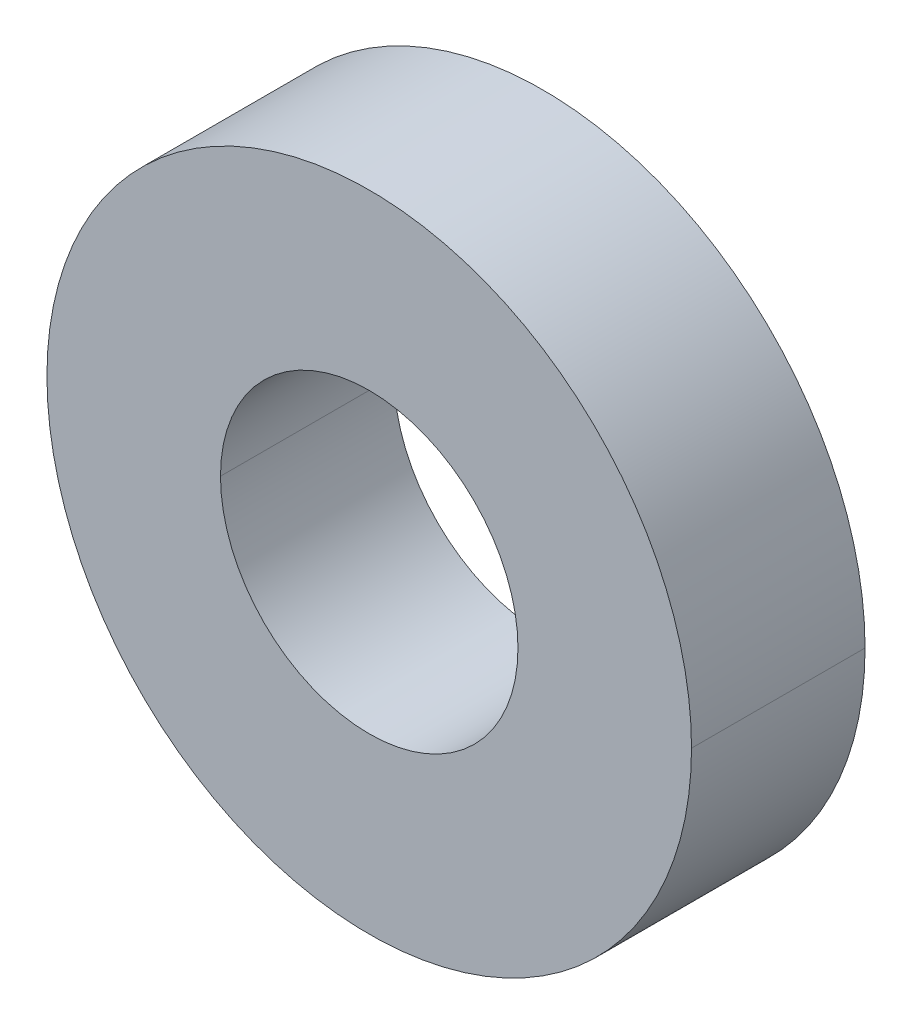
ISO-10303-21;
HEADER;
FILE_DESCRIPTION(('STEP AP214'),'2;1');
FILE_NAME('part.step','',(''),(''),'','','');
FILE_SCHEMA(('AUTOMOTIVE_DESIGN { 1 0 10303 214 1 1 1 1 }'));
ENDSEC;
DATA;
#1=APPLICATION_CONTEXT('core data for automotive mechanical design processes');
#2=APPLICATION_PROTOCOL_DEFINITION('international standard','automotive_design',2000,#1);
#3=PRODUCT_CONTEXT('',#1,'mechanical');
#4=PRODUCT('Part','Part','',(#3));
#5=PRODUCT_RELATED_PRODUCT_CATEGORY('part','',(#4));
#6=PRODUCT_DEFINITION_FORMATION('','',#4);
#7=PRODUCT_DEFINITION_CONTEXT('part definition',#1,'design');
#8=PRODUCT_DEFINITION('design','',#6,#7);
#9=PRODUCT_DEFINITION_SHAPE('','',#8);
#10=(LENGTH_UNIT() NAMED_UNIT(*) SI_UNIT(.MILLI.,.METRE.));
#11=(NAMED_UNIT(*) PLANE_ANGLE_UNIT() SI_UNIT($,.RADIAN.));
#12=(NAMED_UNIT(*) SI_UNIT($,.STERADIAN.) SOLID_ANGLE_UNIT());
#13=UNCERTAINTY_MEASURE_WITH_UNIT(LENGTH_MEASURE(1.E-05),#10,'distance_accuracy_value','');
#14=(GEOMETRIC_REPRESENTATION_CONTEXT(3) GLOBAL_UNCERTAINTY_ASSIGNED_CONTEXT((#13)) GLOBAL_UNIT_ASSIGNED_CONTEXT((#10,
#11,#12)) REPRESENTATION_CONTEXT('',''));
#15=CARTESIAN_POINT('',(0.,0.,0.));
#16=DIRECTION('',(0.,0.,1.));
#17=DIRECTION('',(1.,0.,0.));
#18=AXIS2_PLACEMENT_3D('',#15,#16,#17);
#19=CARTESIAN_POINT('',(0.,0.,-5.55625));
#20=DIRECTION('',(0.,0.,-1.));
#21=DIRECTION('',(-1.,0.,0.));
#22=AXIS2_PLACEMENT_3D('',#19,#20,#21);
#23=PLANE('',#22);
#24=CARTESIAN_POINT('',(0.,0.,-5.55625));
#25=DIRECTION('',(0.,0.,1.));
#26=DIRECTION('',(1.,0.,0.));
#27=AXIS2_PLACEMENT_3D('',#24,#25,#26);
#28=CIRCLE('',#27,20.6375);
#29=CARTESIAN_POINT('',(-20.6375,0.,-5.55625));
#30=VERTEX_POINT('',#29);
#31=CARTESIAN_POINT('',(20.6375,0.,-5.55625));
#32=VERTEX_POINT('',#31);
#33=EDGE_CURVE('E74',#30,#32,#28,.T.);
#34=ORIENTED_EDGE('',*,*,#33,.F.);
#35=CARTESIAN_POINT('',(0.,0.,-5.55625));
#36=DIRECTION('',(0.,0.,1.));
#37=DIRECTION('',(1.,0.,0.));
#38=AXIS2_PLACEMENT_3D('',#35,#36,#37);
#39=CIRCLE('',#38,20.6375);
#40=EDGE_CURVE('E66',#32,#30,#39,.T.);
#41=ORIENTED_EDGE('',*,*,#40,.F.);
#42=EDGE_LOOP('',(#34,#41));
#43=FACE_BOUND('',#42,.T.);
#44=CARTESIAN_POINT('',(0.,0.,-5.55625));
#45=DIRECTION('',(0.,0.,1.));
#46=DIRECTION('',(1.,0.,0.));
#47=AXIS2_PLACEMENT_3D('',#44,#45,#46);
#48=CIRCLE('',#47,9.525);
#49=CARTESIAN_POINT('',(9.525,0.,-5.55625));
#50=VERTEX_POINT('',#49);
#51=CARTESIAN_POINT('',(-9.525,0.,-5.55625));
#52=VERTEX_POINT('',#51);
#53=EDGE_CURVE('E53',#50,#52,#48,.T.);
#54=ORIENTED_EDGE('',*,*,#53,.T.);
#55=CARTESIAN_POINT('',(0.,0.,-5.55625));
#56=DIRECTION('',(0.,0.,1.));
#57=DIRECTION('',(1.,0.,0.));
#58=AXIS2_PLACEMENT_3D('',#55,#56,#57);
#59=CIRCLE('',#58,9.525);
#60=EDGE_CURVE('E19',#52,#50,#59,.T.);
#61=ORIENTED_EDGE('',*,*,#60,.T.);
#62=EDGE_LOOP('',(#54,#61));
#63=FACE_BOUND('',#62,.T.);
#64=ADVANCED_FACE('F16',(#43,#63),#23,.T.);
#65=CARTESIAN_POINT('',(0.,0.,0.));
#66=DIRECTION('',(0.,0.,1.));
#67=DIRECTION('',(1.,0.,0.));
#68=AXIS2_PLACEMENT_3D('',#65,#66,#67);
#69=CYLINDRICAL_SURFACE('',#68,9.525);
#70=ORIENTED_EDGE('',*,*,#60,.F.);
#71=DIRECTION('',(0.,0.,1.));
#72=VECTOR('',#71,1.);
#73=CARTESIAN_POINT('',(-9.525,0.,0.));
#74=LINE('',#73,#72);
#75=CARTESIAN_POINT('',(-9.525,0.,5.55625));
#76=VERTEX_POINT('',#75);
#77=EDGE_CURVE('E67',#52,#76,#74,.T.);
#78=ORIENTED_EDGE('',*,*,#77,.T.);
#79=CARTESIAN_POINT('',(0.,0.,5.55625));
#80=DIRECTION('',(0.,0.,1.));
#81=DIRECTION('',(1.,0.,0.));
#82=AXIS2_PLACEMENT_3D('',#79,#80,#81);
#83=CIRCLE('',#82,9.525);
#84=CARTESIAN_POINT('',(9.525,0.,5.55625));
#85=VERTEX_POINT('',#84);
#86=EDGE_CURVE('E62',#85,#76,#83,.F.);
#87=ORIENTED_EDGE('',*,*,#86,.F.);
#88=DIRECTION('',(0.,0.,1.));
#89=VECTOR('',#88,1.);
#90=CARTESIAN_POINT('',(9.525,0.,0.));
#91=LINE('',#90,#89);
#92=EDGE_CURVE('E59',#85,#50,#91,.F.);
#93=ORIENTED_EDGE('',*,*,#92,.T.);
#94=EDGE_LOOP('',(#70,#78,#87,#93));
#95=FACE_BOUND('',#94,.T.);
#96=ADVANCED_FACE('F60',(#95),#69,.F.);
#97=CARTESIAN_POINT('',(0.,0.,0.));
#98=DIRECTION('',(0.,0.,1.));
#99=DIRECTION('',(1.,0.,0.));
#100=AXIS2_PLACEMENT_3D('',#97,#98,#99);
#101=CYLINDRICAL_SURFACE('',#100,9.525);
#102=CARTESIAN_POINT('',(0.,0.,5.55625));
#103=DIRECTION('',(0.,0.,1.));
#104=DIRECTION('',(1.,0.,0.));
#105=AXIS2_PLACEMENT_3D('',#102,#103,#104);
#106=CIRCLE('',#105,9.525);
#107=EDGE_CURVE('E78',#76,#85,#106,.F.);
#108=ORIENTED_EDGE('',*,*,#107,.F.);
#109=ORIENTED_EDGE('',*,*,#77,.F.);
#110=ORIENTED_EDGE('',*,*,#53,.F.);
#111=ORIENTED_EDGE('',*,*,#92,.F.);
#112=EDGE_LOOP('',(#108,#109,#110,#111));
#113=FACE_BOUND('',#112,.T.);
#114=ADVANCED_FACE('F69',(#113),#101,.F.);
#115=CARTESIAN_POINT('',(0.,0.,0.));
#116=DIRECTION('',(0.,0.,1.));
#117=DIRECTION('',(1.,0.,0.));
#118=AXIS2_PLACEMENT_3D('',#115,#116,#117);
#119=CYLINDRICAL_SURFACE('',#118,20.6375);
#120=DIRECTION('',(0.,0.,1.));
#121=VECTOR('',#120,1.);
#122=CARTESIAN_POINT('',(-20.6375,0.,0.));
#123=LINE('',#122,#121);
#124=CARTESIAN_POINT('',(-20.6375,0.,5.55625));
#125=VERTEX_POINT('',#124);
#126=EDGE_CURVE('E34',#125,#30,#123,.F.);
#127=ORIENTED_EDGE('',*,*,#126,.F.);
#128=CARTESIAN_POINT('',(0.,0.,5.55625));
#129=DIRECTION('',(0.,0.,1.));
#130=DIRECTION('',(1.,0.,0.));
#131=AXIS2_PLACEMENT_3D('',#128,#129,#130);
#132=CIRCLE('',#131,20.6375);
#133=CARTESIAN_POINT('',(20.6375,0.,5.55625));
#134=VERTEX_POINT('',#133);
#135=EDGE_CURVE('E25',#134,#125,#132,.T.);
#136=ORIENTED_EDGE('',*,*,#135,.F.);
#137=DIRECTION('',(0.,0.,1.));
#138=VECTOR('',#137,1.);
#139=CARTESIAN_POINT('',(20.6375,0.,0.));
#140=LINE('',#139,#138);
#141=EDGE_CURVE('E73',#32,#134,#140,.T.);
#142=ORIENTED_EDGE('',*,*,#141,.F.);
#143=ORIENTED_EDGE('',*,*,#40,.T.);
#144=EDGE_LOOP('',(#127,#136,#142,#143));
#145=FACE_BOUND('',#144,.T.);
#146=ADVANCED_FACE('F91',(#145),#119,.T.);
#147=CARTESIAN_POINT('',(0.,0.,0.));
#148=DIRECTION('',(0.,0.,1.));
#149=DIRECTION('',(1.,0.,0.));
#150=AXIS2_PLACEMENT_3D('',#147,#148,#149);
#151=CYLINDRICAL_SURFACE('',#150,20.6375);
#152=ORIENTED_EDGE('',*,*,#126,.T.);
#153=ORIENTED_EDGE('',*,*,#33,.T.);
#154=ORIENTED_EDGE('',*,*,#141,.T.);
#155=CARTESIAN_POINT('',(0.,0.,5.55625));
#156=DIRECTION('',(0.,0.,1.));
#157=DIRECTION('',(1.,0.,0.));
#158=AXIS2_PLACEMENT_3D('',#155,#156,#157);
#159=CIRCLE('',#158,20.6375);
#160=EDGE_CURVE('E11',#125,#134,#159,.T.);
#161=ORIENTED_EDGE('',*,*,#160,.F.);
#162=EDGE_LOOP('',(#152,#153,#154,#161));
#163=FACE_BOUND('',#162,.T.);
#164=ADVANCED_FACE('F86',(#163),#151,.T.);
#165=CARTESIAN_POINT('',(0.,0.,5.55625));
#166=DIRECTION('',(0.,0.,1.));
#167=DIRECTION('',(1.,0.,0.));
#168=AXIS2_PLACEMENT_3D('',#165,#166,#167);
#169=PLANE('',#168);
#170=ORIENTED_EDGE('',*,*,#135,.T.);
#171=ORIENTED_EDGE('',*,*,#160,.T.);
#172=EDGE_LOOP('',(#170,#171));
#173=FACE_BOUND('',#172,.T.);
#174=ORIENTED_EDGE('',*,*,#86,.T.);
#175=ORIENTED_EDGE('',*,*,#107,.T.);
#176=EDGE_LOOP('',(#174,#175));
#177=FACE_BOUND('',#176,.T.);
#178=ADVANCED_FACE('F89',(#173,#177),#169,.T.);
#179=CLOSED_SHELL('',(#64,#96,#114,#146,#164,#178));
#180=MANIFOLD_SOLID_BREP('B1',#179);
#181=ADVANCED_BREP_SHAPE_REPRESENTATION('',(#18,#180),#14);
#182=SHAPE_DEFINITION_REPRESENTATION(#9,#181);
ENDSEC;
END-ISO-10303-21;
